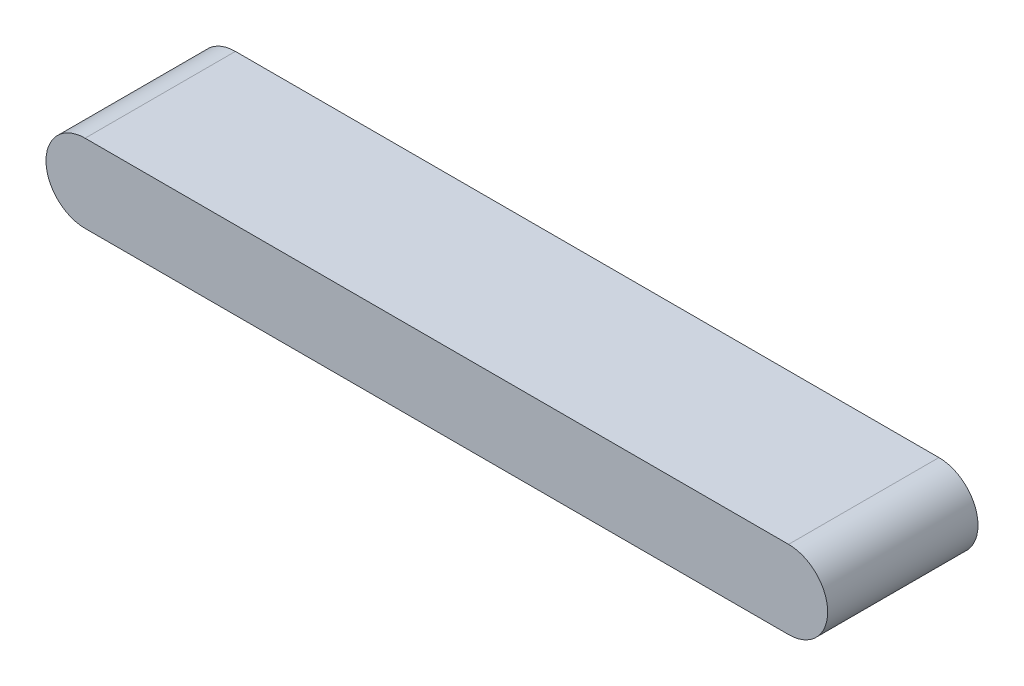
from build123d import *

# Parameters (mm, degrees)
BOSS_EXTRUDE1_DEPTH = 63.5


with BuildPart() as part:
    # Sketch1 → Boss-Extrude1 (new body)
    with BuildSketch(Plane.XY):
        with BuildLine():
            Line((0, 16.51), (297.18, 16.51))
            ThreePointArc((297.18, 16.51), (313.69, 0), (297.18, -16.51))
            Line((297.18, -16.51), (0, -16.51))
            ThreePointArc((0, -16.51), (-16.51, 0), (0, 16.51))
        make_face()
    extrude(amount=BOSS_EXTRUDE1_DEPTH)


solid = part.part
